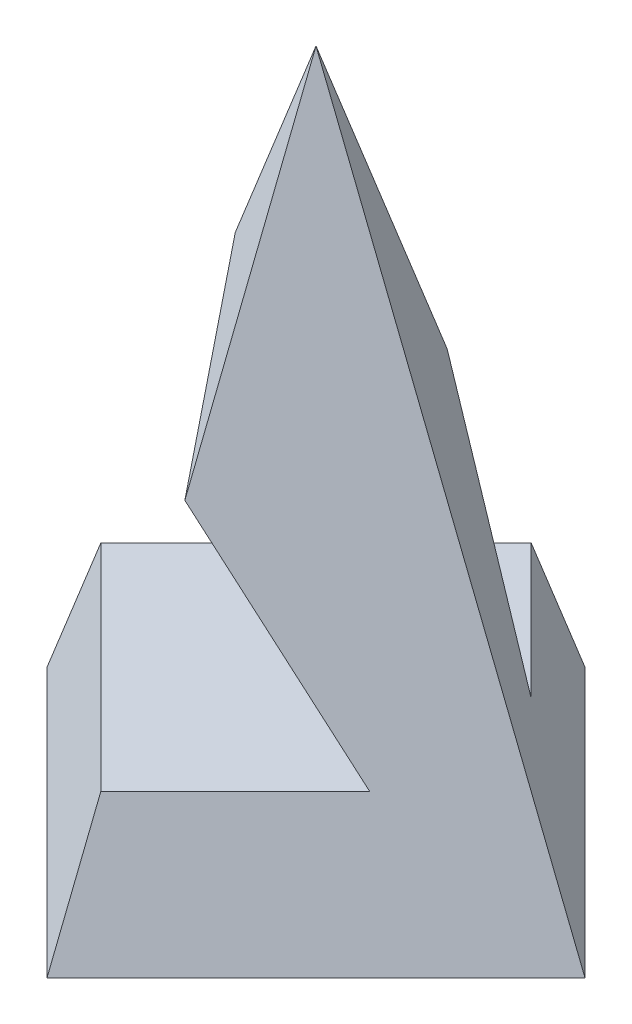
ISO-10303-21;
HEADER;
FILE_DESCRIPTION(('STEP AP214'),'2;1');
FILE_NAME('part.step','',(''),(''),'','','');
FILE_SCHEMA(('AUTOMOTIVE_DESIGN { 1 0 10303 214 1 1 1 1 }'));
ENDSEC;
DATA;
#1=APPLICATION_CONTEXT('core data for automotive mechanical design processes');
#2=APPLICATION_PROTOCOL_DEFINITION('international standard','automotive_design',2000,#1);
#3=PRODUCT_CONTEXT('',#1,'mechanical');
#4=PRODUCT('Part','Part','',(#3));
#5=PRODUCT_RELATED_PRODUCT_CATEGORY('part','',(#4));
#6=PRODUCT_DEFINITION_FORMATION('','',#4);
#7=PRODUCT_DEFINITION_CONTEXT('part definition',#1,'design');
#8=PRODUCT_DEFINITION('design','',#6,#7);
#9=PRODUCT_DEFINITION_SHAPE('','',#8);
#10=(LENGTH_UNIT() NAMED_UNIT(*) SI_UNIT(.MILLI.,.METRE.));
#11=(NAMED_UNIT(*) PLANE_ANGLE_UNIT() SI_UNIT($,.RADIAN.));
#12=(NAMED_UNIT(*) SI_UNIT($,.STERADIAN.) SOLID_ANGLE_UNIT());
#13=UNCERTAINTY_MEASURE_WITH_UNIT(LENGTH_MEASURE(1.E-05),#10,'distance_accuracy_value','');
#14=(GEOMETRIC_REPRESENTATION_CONTEXT(3) GLOBAL_UNCERTAINTY_ASSIGNED_CONTEXT((#13)) GLOBAL_UNIT_ASSIGNED_CONTEXT((#10,
#11,#12)) REPRESENTATION_CONTEXT('',''));
#15=CARTESIAN_POINT('',(0.,0.,0.));
#16=DIRECTION('',(0.,0.,1.));
#17=DIRECTION('',(1.,0.,0.));
#18=AXIS2_PLACEMENT_3D('',#15,#16,#17);
#19=CARTESIAN_POINT('',(-16.,0.,0.));
#20=DIRECTION('',(-0.680413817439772,0.272165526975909,0.680413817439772));
#21=DIRECTION('',(0.707106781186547,0.,0.707106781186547));
#22=AXIS2_PLACEMENT_3D('',#19,#20,#21);
#23=PLANE('',#22);
#24=DIRECTION('',(0.,-0.928476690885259,0.371390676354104));
#25=VECTOR('',#24,1.);
#26=CARTESIAN_POINT('',(0.,40.,0.));
#27=LINE('',#26,#25);
#28=CARTESIAN_POINT('',(0.,8.,12.8));
#29=VERTEX_POINT('',#28);
#30=CARTESIAN_POINT('',(0.,0.,16.));
#31=VERTEX_POINT('',#30);
#32=EDGE_CURVE('E52',#29,#31,#27,.T.);
#33=ORIENTED_EDGE('',*,*,#32,.F.);
#34=DIRECTION('',(-0.707106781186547,0.,-0.707106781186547));
#35=VECTOR('',#34,1.);
#36=CARTESIAN_POINT('',(-14.4,8.,-1.6));
#37=LINE('',#36,#35);
#38=CARTESIAN_POINT('',(-12.8,8.,0.));
#39=VERTEX_POINT('',#38);
#40=EDGE_CURVE('E114',#29,#39,#37,.T.);
#41=ORIENTED_EDGE('',*,*,#40,.T.);
#42=DIRECTION('',(-0.371390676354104,-0.928476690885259,0.));
#43=VECTOR('',#42,1.);
#44=CARTESIAN_POINT('',(0.,40.,0.));
#45=LINE('',#44,#43);
#46=CARTESIAN_POINT('',(-16.,0.,0.));
#47=VERTEX_POINT('',#46);
#48=EDGE_CURVE('E75',#39,#47,#45,.T.);
#49=ORIENTED_EDGE('',*,*,#48,.T.);
#50=DIRECTION('',(0.707106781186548,0.,0.707106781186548));
#51=VECTOR('',#50,1.);
#52=CARTESIAN_POINT('',(-16.,0.,0.));
#53=LINE('',#52,#51);
#54=EDGE_CURVE('E186',#47,#31,#53,.T.);
#55=ORIENTED_EDGE('',*,*,#54,.T.);
#56=EDGE_LOOP('',(#33,#41,#49,#55));
#57=FACE_BOUND('',#56,.T.);
#58=ADVANCED_FACE('F47',(#57),#23,.T.);
#59=CARTESIAN_POINT('',(0.,40.,0.));
#60=VERTEX_POINT('',#59);
#61=CARTESIAN_POINT('',(-4.8,28.,0.));
#62=VERTEX_POINT('',#61);
#63=EDGE_CURVE('E245',#60,#62,#45,.T.);
#64=ORIENTED_EDGE('',*,*,#63,.T.);
#65=DIRECTION('',(0.405485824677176,-0.633571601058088,0.658914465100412));
#66=VECTOR('',#65,1.);
#67=CARTESIAN_POINT('',(0.551830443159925,19.6377649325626,8.69672447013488));
#68=LINE('',#67,#66);
#69=CARTESIAN_POINT('',(0.,20.5,7.8));
#70=VERTEX_POINT('',#69);
#71=EDGE_CURVE('E133',#62,#70,#68,.T.);
#72=ORIENTED_EDGE('',*,*,#71,.T.);
#73=EDGE_CURVE('E130',#60,#70,#27,.T.);
#74=ORIENTED_EDGE('',*,*,#73,.F.);
#75=EDGE_LOOP('',(#64,#72,#74));
#76=FACE_BOUND('',#75,.T.);
#77=ADVANCED_FACE('F171',(#76),#23,.T.);
#78=CARTESIAN_POINT('',(0.,0.,16.));
#79=DIRECTION('',(0.680413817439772,0.272165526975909,0.680413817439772));
#80=DIRECTION('',(0.707106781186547,0.,-0.707106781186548));
#81=AXIS2_PLACEMENT_3D('',#78,#79,#80);
#82=PLANE('',#81);
#83=DIRECTION('',(0.528366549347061,-0.825572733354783,-0.198137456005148));
#84=VECTOR('',#83,1.);
#85=CARTESIAN_POINT('',(8.08375136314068,7.86913849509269,4.76859323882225));
#86=LINE('',#85,#84);
#87=CARTESIAN_POINT('',(8.,8.,4.79999999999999));
#88=VERTEX_POINT('',#87);
#89=EDGE_CURVE('E122',#70,#88,#86,.T.);
#90=ORIENTED_EDGE('',*,*,#89,.T.);
#91=DIRECTION('',(-0.707106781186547,0.,0.707106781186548));
#92=VECTOR('',#91,1.);
#93=CARTESIAN_POINT('',(-1.6,8.,14.4));
#94=LINE('',#93,#92);
#95=EDGE_CURVE('E110',#88,#29,#94,.T.);
#96=ORIENTED_EDGE('',*,*,#95,.T.);
#97=ORIENTED_EDGE('',*,*,#32,.T.);
#98=DIRECTION('',(0.707106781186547,0.,-0.707106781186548));
#99=VECTOR('',#98,1.);
#100=CARTESIAN_POINT('',(0.,0.,16.));
#101=LINE('',#100,#99);
#102=CARTESIAN_POINT('',(16.,0.,0.));
#103=VERTEX_POINT('',#102);
#104=EDGE_CURVE('E225',#31,#103,#101,.T.);
#105=ORIENTED_EDGE('',*,*,#104,.T.);
#106=DIRECTION('',(0.371390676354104,-0.928476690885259,0.));
#107=VECTOR('',#106,1.);
#108=CARTESIAN_POINT('',(0.,40.,0.));
#109=LINE('',#108,#107);
#110=EDGE_CURVE('E119',#60,#103,#109,.T.);
#111=ORIENTED_EDGE('',*,*,#110,.F.);
#112=ORIENTED_EDGE('',*,*,#73,.T.);
#113=EDGE_LOOP('',(#90,#96,#97,#105,#111,#112));
#114=FACE_BOUND('',#113,.T.);
#115=ADVANCED_FACE('F127',(#114),#82,.T.);
#116=CARTESIAN_POINT('',(0.,0.,-16.));
#117=DIRECTION('',(-0.680413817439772,0.272165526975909,-0.680413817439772));
#118=DIRECTION('',(-0.707106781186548,0.,0.707106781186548));
#119=AXIS2_PLACEMENT_3D('',#116,#117,#118);
#120=PLANE('',#119);
#121=ORIENTED_EDGE('',*,*,#48,.F.);
#122=DIRECTION('',(0.707106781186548,0.,-0.707106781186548));
#123=VECTOR('',#122,1.);
#124=CARTESIAN_POINT('',(1.6,8.,-14.4));
#125=LINE('',#124,#123);
#126=CARTESIAN_POINT('',(0.,8.,-12.8));
#127=VERTEX_POINT('',#126);
#128=EDGE_CURVE('E132',#39,#127,#125,.T.);
#129=ORIENTED_EDGE('',*,*,#128,.T.);
#130=DIRECTION('',(0.,-0.928476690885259,-0.371390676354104));
#131=VECTOR('',#130,1.);
#132=CARTESIAN_POINT('',(0.,40.,0.));
#133=LINE('',#132,#131);
#134=CARTESIAN_POINT('',(0.,0.,-16.));
#135=VERTEX_POINT('',#134);
#136=EDGE_CURVE('E235',#127,#135,#133,.T.);
#137=ORIENTED_EDGE('',*,*,#136,.T.);
#138=DIRECTION('',(-0.707106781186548,0.,0.707106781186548));
#139=VECTOR('',#138,1.);
#140=CARTESIAN_POINT('',(0.,0.,-16.));
#141=LINE('',#140,#139);
#142=EDGE_CURVE('E147',#135,#47,#141,.T.);
#143=ORIENTED_EDGE('',*,*,#142,.T.);
#144=EDGE_LOOP('',(#121,#129,#137,#143));
#145=FACE_BOUND('',#144,.T.);
#146=ADVANCED_FACE('F155',(#145),#120,.T.);
#147=CARTESIAN_POINT('',(0.,20.5,-7.8));
#148=VERTEX_POINT('',#147);
#149=EDGE_CURVE('E153',#60,#148,#133,.T.);
#150=ORIENTED_EDGE('',*,*,#149,.T.);
#151=DIRECTION('',(-0.405485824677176,0.633571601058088,0.658914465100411));
#152=VECTOR('',#151,1.);
#153=CARTESIAN_POINT('',(7.45741811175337,8.84778420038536,-19.9183044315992));
#154=LINE('',#153,#152);
#155=EDGE_CURVE('E67',#148,#62,#154,.T.);
#156=ORIENTED_EDGE('',*,*,#155,.T.);
#157=ORIENTED_EDGE('',*,*,#63,.F.);
#158=EDGE_LOOP('',(#150,#156,#157));
#159=FACE_BOUND('',#158,.T.);
#160=ADVANCED_FACE('F165',(#159),#120,.T.);
#161=CARTESIAN_POINT('',(16.,0.,0.));
#162=DIRECTION('',(0.680413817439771,0.272165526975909,-0.680413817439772));
#163=DIRECTION('',(-0.707106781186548,0.,-0.707106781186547));
#164=AXIS2_PLACEMENT_3D('',#161,#162,#163);
#165=PLANE('',#164);
#166=ORIENTED_EDGE('',*,*,#136,.F.);
#167=DIRECTION('',(0.707106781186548,0.,0.707106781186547));
#168=VECTOR('',#167,1.);
#169=CARTESIAN_POINT('',(14.4,8.,1.6));
#170=LINE('',#169,#168);
#171=CARTESIAN_POINT('',(8.,8.,-4.8));
#172=VERTEX_POINT('',#171);
#173=EDGE_CURVE('E12',#127,#172,#170,.T.);
#174=ORIENTED_EDGE('',*,*,#173,.T.);
#175=DIRECTION('',(-0.528366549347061,0.825572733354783,-0.198137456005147));
#176=VECTOR('',#175,1.);
#177=CARTESIAN_POINT('',(14.2255179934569,-1.72737186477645,-2.46543075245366));
#178=LINE('',#177,#176);
#179=EDGE_CURVE('E59',#172,#148,#178,.T.);
#180=ORIENTED_EDGE('',*,*,#179,.T.);
#181=ORIENTED_EDGE('',*,*,#149,.F.);
#182=ORIENTED_EDGE('',*,*,#110,.T.);
#183=DIRECTION('',(-0.707106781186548,0.,-0.707106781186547));
#184=VECTOR('',#183,1.);
#185=CARTESIAN_POINT('',(16.,0.,0.));
#186=LINE('',#185,#184);
#187=EDGE_CURVE('E206',#103,#135,#186,.T.);
#188=ORIENTED_EDGE('',*,*,#187,.T.);
#189=EDGE_LOOP('',(#166,#174,#180,#181,#182,#188));
#190=FACE_BOUND('',#189,.T.);
#191=ADVANCED_FACE('F166',(#190),#165,.T.);
#192=CARTESIAN_POINT('',(-16.,0.,0.));
#193=DIRECTION('',(0.,-1.,0.));
#194=DIRECTION('',(0.,0.,-1.));
#195=AXIS2_PLACEMENT_3D('',#192,#193,#194);
#196=PLANE('',#195);
#197=ORIENTED_EDGE('',*,*,#54,.F.);
#198=ORIENTED_EDGE('',*,*,#142,.F.);
#199=ORIENTED_EDGE('',*,*,#187,.F.);
#200=ORIENTED_EDGE('',*,*,#104,.F.);
#201=EDGE_LOOP('',(#197,#198,#199,#200));
#202=FACE_BOUND('',#201,.T.);
#203=ADVANCED_FACE('F49',(#202),#196,.T.);
#204=CARTESIAN_POINT('',(-15.5302890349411,8.,76.1942625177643));
#205=DIRECTION('',(0.,1.,0.));
#206=DIRECTION('',(0.,0.,1.));
#207=AXIS2_PLACEMENT_3D('',#204,#205,#206);
#208=PLANE('',#207);
#209=ORIENTED_EDGE('',*,*,#95,.F.);
#210=DIRECTION('',(0.,0.,-1.));
#211=VECTOR('',#210,1.);
#212=CARTESIAN_POINT('',(8.,8.,76.1942625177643));
#213=LINE('',#212,#211);
#214=EDGE_CURVE('E113',#88,#172,#213,.T.);
#215=ORIENTED_EDGE('',*,*,#214,.T.);
#216=ORIENTED_EDGE('',*,*,#173,.F.);
#217=ORIENTED_EDGE('',*,*,#128,.F.);
#218=ORIENTED_EDGE('',*,*,#40,.F.);
#219=EDGE_LOOP('',(#209,#215,#216,#217,#218));
#220=FACE_BOUND('',#219,.T.);
#221=ADVANCED_FACE('F112',(#220),#208,.T.);
#222=CARTESIAN_POINT('',(8.,8.,76.1942625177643));
#223=DIRECTION('',(-0.842271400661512,-0.539053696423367,0.));
#224=DIRECTION('',(0.539053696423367,-0.842271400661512,0.));
#225=AXIS2_PLACEMENT_3D('',#222,#223,#224);
#226=PLANE('',#225);
#227=ORIENTED_EDGE('',*,*,#89,.F.);
#228=ORIENTED_EDGE('',*,*,#71,.F.);
#229=ORIENTED_EDGE('',*,*,#155,.F.);
#230=ORIENTED_EDGE('',*,*,#179,.F.);
#231=ORIENTED_EDGE('',*,*,#214,.F.);
#232=EDGE_LOOP('',(#227,#228,#229,#230,#231));
#233=FACE_BOUND('',#232,.T.);
#234=ADVANCED_FACE('F121',(#233),#226,.T.);
#235=CLOSED_SHELL('',(#58,#77,#115,#146,#160,#191,#203,#221,#234));
#236=MANIFOLD_SOLID_BREP('B2',#235);
#237=ADVANCED_BREP_SHAPE_REPRESENTATION('',(#18,#236),#14);
#238=SHAPE_DEFINITION_REPRESENTATION(#9,#237);
ENDSEC;
END-ISO-10303-21;
